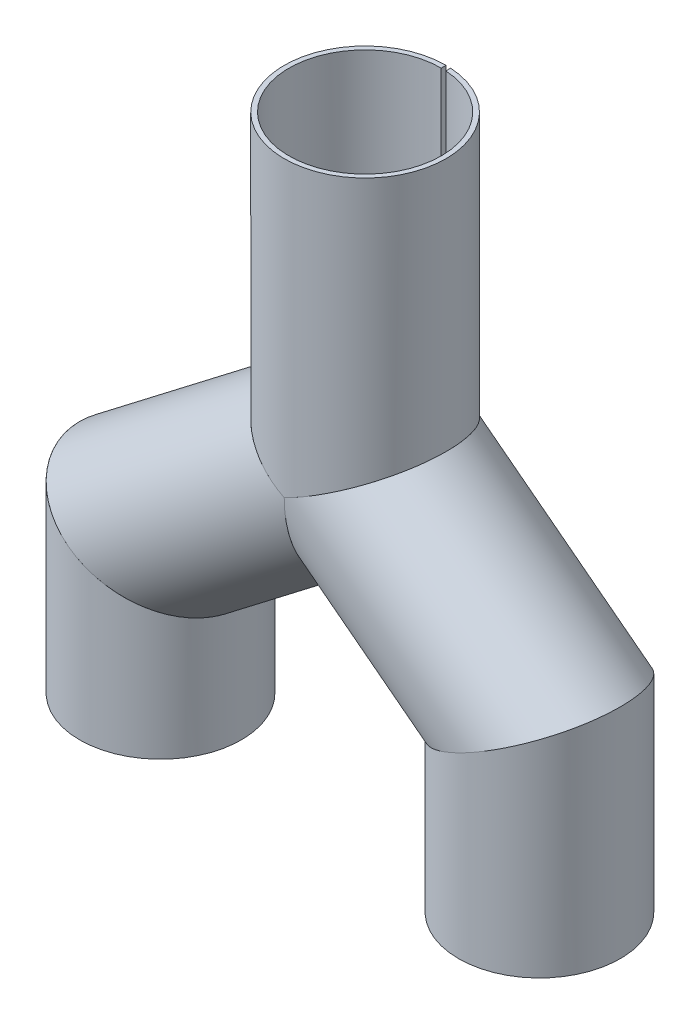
ISO-10303-21;
HEADER;
FILE_DESCRIPTION(('STEP AP214'),'2;1');
FILE_NAME('part.step','',(''),(''),'','','');
FILE_SCHEMA(('AUTOMOTIVE_DESIGN { 1 0 10303 214 1 1 1 1 }'));
ENDSEC;
DATA;
#1=APPLICATION_CONTEXT('core data for automotive mechanical design processes');
#2=APPLICATION_PROTOCOL_DEFINITION('international standard','automotive_design',2000,#1);
#3=PRODUCT_CONTEXT('',#1,'mechanical');
#4=PRODUCT('Part','Part','',(#3));
#5=PRODUCT_RELATED_PRODUCT_CATEGORY('part','',(#4));
#6=PRODUCT_DEFINITION_FORMATION('','',#4);
#7=PRODUCT_DEFINITION_CONTEXT('part definition',#1,'design');
#8=PRODUCT_DEFINITION('design','',#6,#7);
#9=PRODUCT_DEFINITION_SHAPE('','',#8);
#10=(LENGTH_UNIT() NAMED_UNIT(*) SI_UNIT(.MILLI.,.METRE.));
#11=(NAMED_UNIT(*) PLANE_ANGLE_UNIT() SI_UNIT($,.RADIAN.));
#12=(NAMED_UNIT(*) SI_UNIT($,.STERADIAN.) SOLID_ANGLE_UNIT());
#13=UNCERTAINTY_MEASURE_WITH_UNIT(LENGTH_MEASURE(1.E-05),#10,'distance_accuracy_value','');
#14=(GEOMETRIC_REPRESENTATION_CONTEXT(3) GLOBAL_UNCERTAINTY_ASSIGNED_CONTEXT((#13)) GLOBAL_UNIT_ASSIGNED_CONTEXT((#10,
#11,#12)) REPRESENTATION_CONTEXT('',''));
#15=CARTESIAN_POINT('',(0.,0.,0.));
#16=DIRECTION('',(0.,0.,1.));
#17=DIRECTION('',(1.,0.,0.));
#18=AXIS2_PLACEMENT_3D('',#15,#16,#17);
#19=CARTESIAN_POINT('',(-42.9377584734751,-24.5860223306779,0.));
#20=DIRECTION('',(0.,-1.,0.));
#21=DIRECTION('',(0.,0.,-1.));
#22=AXIS2_PLACEMENT_3D('',#19,#20,#21);
#23=CYLINDRICAL_SURFACE('',#22,16.9771800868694);
#24=CARTESIAN_POINT('',(-42.9377584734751,-65.4896522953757,0.));
#25=DIRECTION('',(0.,1.,0.));
#26=DIRECTION('',(0.,0.,1.));
#27=AXIS2_PLACEMENT_3D('',#24,#25,#26);
#28=CIRCLE('',#27,16.9771800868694);
#29=CARTESIAN_POINT('',(-43.4377584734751,-65.4896522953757,-16.9698156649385));
#30=VERTEX_POINT('',#29);
#31=CARTESIAN_POINT('',(-42.4377584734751,-65.4896522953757,-16.9698156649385));
#32=VERTEX_POINT('',#31);
#33=EDGE_CURVE('E129',#30,#32,#28,.T.);
#34=ORIENTED_EDGE('',*,*,#33,.T.);
#35=DIRECTION('',(0.,-1.,0.));
#36=VECTOR('',#35,1.);
#37=CARTESIAN_POINT('',(-42.4377584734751,-24.5860223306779,-16.9698156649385));
#38=LINE('',#37,#36);
#39=CARTESIAN_POINT('',(-42.4377584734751,-33.203305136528,-16.9698156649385));
#40=VERTEX_POINT('',#39);
#41=EDGE_CURVE('E141',#32,#40,#38,.F.);
#42=ORIENTED_EDGE('',*,*,#41,.T.);
#43=CARTESIAN_POINT('',(-42.9377584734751,-32.9567755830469,0.));
#44=DIRECTION('',(0.442226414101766,0.8969034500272,0.));
#45=DIRECTION('',(0.8969034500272,-0.442226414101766,0.));
#46=AXIS2_PLACEMENT_3D('',#43,#44,#45);
#47=ELLIPSE('',#46,18.928659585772,16.9771800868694);
#48=CARTESIAN_POINT('',(-43.4377584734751,-32.7102460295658,-16.9698156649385));
#49=VERTEX_POINT('',#48);
#50=EDGE_CURVE('E140',#49,#40,#47,.T.);
#51=ORIENTED_EDGE('',*,*,#50,.F.);
#52=DIRECTION('',(0.,-1.,0.));
#53=VECTOR('',#52,1.);
#54=CARTESIAN_POINT('',(-43.4377584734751,-24.5860223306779,-16.9698156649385));
#55=LINE('',#54,#53);
#56=EDGE_CURVE('E99',#30,#49,#55,.F.);
#57=ORIENTED_EDGE('',*,*,#56,.F.);
#58=EDGE_LOOP('',(#34,#42,#51,#57));
#59=FACE_BOUND('',#58,.T.);
#60=ADVANCED_FACE('F85',(#59),#23,.T.);
#61=CARTESIAN_POINT('',(-42.9377584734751,-24.5860223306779,0.));
#62=DIRECTION('',(0.,-1.,0.));
#63=DIRECTION('',(0.,0.,-1.));
#64=AXIS2_PLACEMENT_3D('',#61,#62,#63);
#65=CYLINDRICAL_SURFACE('',#64,15.9771800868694);
#66=DIRECTION('',(0.,-1.,0.));
#67=VECTOR('',#66,1.);
#68=CARTESIAN_POINT('',(-42.4377584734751,-24.5860223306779,-15.9693545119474));
#69=LINE('',#68,#67);
#70=CARTESIAN_POINT('',(-42.4377584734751,-65.4896522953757,-15.9693545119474));
#71=VERTEX_POINT('',#70);
#72=CARTESIAN_POINT('',(-42.4377584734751,-33.203305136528,-15.9693545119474));
#73=VERTEX_POINT('',#72);
#74=EDGE_CURVE('E106',#71,#73,#69,.F.);
#75=ORIENTED_EDGE('',*,*,#74,.F.);
#76=CARTESIAN_POINT('',(-42.9377584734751,-65.4896522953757,0.));
#77=DIRECTION('',(0.,1.,0.));
#78=DIRECTION('',(-1.,0.,0.));
#79=AXIS2_PLACEMENT_3D('',#76,#77,#78);
#80=CIRCLE('',#79,15.9771800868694);
#81=CARTESIAN_POINT('',(-43.4377584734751,-65.4896522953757,-15.9693545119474));
#82=VERTEX_POINT('',#81);
#83=EDGE_CURVE('E136',#82,#71,#80,.T.);
#84=ORIENTED_EDGE('',*,*,#83,.F.);
#85=DIRECTION('',(0.,-1.,0.));
#86=VECTOR('',#85,1.);
#87=CARTESIAN_POINT('',(-43.4377584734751,-24.5860223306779,-15.9693545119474));
#88=LINE('',#87,#86);
#89=CARTESIAN_POINT('',(-43.4377584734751,-32.7102460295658,-15.9693545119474));
#90=VERTEX_POINT('',#89);
#91=EDGE_CURVE('E123',#82,#90,#88,.F.);
#92=ORIENTED_EDGE('',*,*,#91,.T.);
#93=CARTESIAN_POINT('',(-42.9377584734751,-32.9567755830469,0.));
#94=DIRECTION('',(0.442226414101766,0.8969034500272,0.));
#95=DIRECTION('',(0.8969034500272,-0.442226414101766,0.));
#96=AXIS2_PLACEMENT_3D('',#93,#94,#95);
#97=ELLIPSE('',#96,17.8137123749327,15.9771800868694);
#98=EDGE_CURVE('E134',#90,#73,#97,.T.);
#99=ORIENTED_EDGE('',*,*,#98,.T.);
#100=EDGE_LOOP('',(#75,#84,#92,#99));
#101=FACE_BOUND('',#100,.T.);
#102=ADVANCED_FACE('F133',(#101),#65,.F.);
#103=CARTESIAN_POINT('',(-42.9377584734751,-65.4896522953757,0.));
#104=DIRECTION('',(0.,1.,0.));
#105=DIRECTION('',(0.,0.,1.));
#106=AXIS2_PLACEMENT_3D('',#103,#104,#105);
#107=PLANE('',#106);
#108=ORIENTED_EDGE('',*,*,#83,.T.);
#109=DIRECTION('',(0.,0.,1.));
#110=VECTOR('',#109,1.);
#111=CARTESIAN_POINT('',(-42.4377584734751,-65.4896522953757,-16.9771800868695));
#112=LINE('',#111,#110);
#113=EDGE_CURVE('E137',#32,#71,#112,.T.);
#114=ORIENTED_EDGE('',*,*,#113,.F.);
#115=ORIENTED_EDGE('',*,*,#33,.F.);
#116=DIRECTION('',(0.,0.,1.));
#117=VECTOR('',#116,1.);
#118=CARTESIAN_POINT('',(-43.4377584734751,-65.4896522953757,-16.9771800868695));
#119=LINE('',#118,#117);
#120=EDGE_CURVE('E152',#30,#82,#119,.T.);
#121=ORIENTED_EDGE('',*,*,#120,.T.);
#122=EDGE_LOOP('',(#108,#114,#115,#121));
#123=FACE_BOUND('',#122,.T.);
#124=ADVANCED_FACE('F158',(#123),#107,.F.);
#125=CARTESIAN_POINT('',(-59.9149385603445,-24.5860223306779,-16.9771800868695));
#126=DIRECTION('',(0.442226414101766,0.8969034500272,0.));
#127=DIRECTION('',(-0.8969034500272,0.442226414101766,0.));
#128=AXIS2_PLACEMENT_3D('',#125,#126,#127);
#129=PLANE('',#128);
#130=DIRECTION('',(0.,0.,-1.));
#131=VECTOR('',#130,1.);
#132=CARTESIAN_POINT('',(-42.4377584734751,-33.203305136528,-16.9771800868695));
#133=LINE('',#132,#131);
#134=EDGE_CURVE('E14',#73,#40,#133,.T.);
#135=ORIENTED_EDGE('',*,*,#134,.F.);
#136=ORIENTED_EDGE('',*,*,#98,.F.);
#137=DIRECTION('',(0.,0.,-1.));
#138=VECTOR('',#137,1.);
#139=CARTESIAN_POINT('',(-43.4377584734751,-32.7102460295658,-16.9771800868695));
#140=LINE('',#139,#138);
#141=EDGE_CURVE('E92',#90,#49,#140,.T.);
#142=ORIENTED_EDGE('',*,*,#141,.T.);
#143=ORIENTED_EDGE('',*,*,#50,.T.);
#144=EDGE_LOOP('',(#135,#136,#142,#143));
#145=FACE_BOUND('',#144,.T.);
#146=ADVANCED_FACE('F139',(#145),#129,.T.);
#147=CARTESIAN_POINT('',(-43.4377584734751,-32.9567755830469,-16.9771800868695));
#148=DIRECTION('',(1.,0.,0.));
#149=DIRECTION('',(0.,0.,-1.));
#150=AXIS2_PLACEMENT_3D('',#147,#148,#149);
#151=PLANE('',#150);
#152=ORIENTED_EDGE('',*,*,#56,.T.);
#153=ORIENTED_EDGE('',*,*,#141,.F.);
#154=ORIENTED_EDGE('',*,*,#91,.F.);
#155=ORIENTED_EDGE('',*,*,#120,.F.);
#156=EDGE_LOOP('',(#152,#153,#154,#155));
#157=FACE_BOUND('',#156,.T.);
#158=ADVANCED_FACE('F122',(#157),#151,.T.);
#159=CARTESIAN_POINT('',(-42.4377584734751,-32.9567755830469,-16.9771800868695));
#160=DIRECTION('',(1.,0.,0.));
#161=DIRECTION('',(0.,0.,-1.));
#162=AXIS2_PLACEMENT_3D('',#159,#160,#161);
#163=PLANE('',#162);
#164=ORIENTED_EDGE('',*,*,#113,.T.);
#165=ORIENTED_EDGE('',*,*,#74,.T.);
#166=ORIENTED_EDGE('',*,*,#134,.T.);
#167=ORIENTED_EDGE('',*,*,#41,.F.);
#168=EDGE_LOOP('',(#164,#165,#166,#167));
#169=FACE_BOUND('',#168,.T.);
#170=ADVANCED_FACE('F155',(#169),#163,.F.);
#171=CLOSED_SHELL('',(#60,#102,#124,#146,#158,#170));
#172=MANIFOLD_SOLID_BREP('B2',#171);
#173=CARTESIAN_POINT('',(0.,0.,0.));
#174=DIRECTION('',(-0.793268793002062,-0.608871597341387,0.));
#175=DIRECTION('',(0.608871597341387,-0.793268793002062,0.));
#176=AXIS2_PLACEMENT_3D('',#173,#174,#175);
#177=CYLINDRICAL_SURFACE('',#176,16.9771800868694);
#178=CARTESIAN_POINT('',(0.,0.,0.));
#179=DIRECTION('',(-0.442226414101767,-0.896903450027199,0.));
#180=DIRECTION('',(-0.896903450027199,0.442226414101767,0.));
#181=AXIS2_PLACEMENT_3D('',#178,#179,#180);
#182=ELLIPSE('',#181,18.928659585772,16.9771800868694);
#183=CARTESIAN_POINT('',(0.,0.,16.9771800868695));
#184=VERTEX_POINT('',#183);
#185=CARTESIAN_POINT('',(0.,0.,-16.9771800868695));
#186=VERTEX_POINT('',#185);
#187=EDGE_CURVE('E242',#184,#186,#182,.T.);
#188=ORIENTED_EDGE('',*,*,#187,.T.);
#189=CARTESIAN_POINT('',(0.,0.,0.));
#190=DIRECTION('',(-1.,0.,0.));
#191=DIRECTION('',(0.,-1.,0.));
#192=AXIS2_PLACEMENT_3D('',#189,#190,#191);
#193=ELLIPSE('',#192,21.4015479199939,16.9771800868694);
#194=EDGE_CURVE('E248',#186,#184,#193,.T.);
#195=ORIENTED_EDGE('',*,*,#194,.T.);
#196=EDGE_LOOP('',(#188,#195));
#197=FACE_BOUND('',#196,.T.);
#198=CARTESIAN_POINT('',(-42.9377584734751,-32.9567755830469,0.));
#199=DIRECTION('',(0.442226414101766,0.8969034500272,0.));
#200=DIRECTION('',(-0.8969034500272,0.442226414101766,0.));
#201=AXIS2_PLACEMENT_3D('',#198,#199,#200);
#202=ELLIPSE('',#201,18.928659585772,16.9771800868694);
#203=CARTESIAN_POINT('',(-59.9149385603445,-24.5860223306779,0.));
#204=VERTEX_POINT('',#203);
#205=EDGE_CURVE('E258',#204,#204,#202,.T.);
#206=ORIENTED_EDGE('',*,*,#205,.T.);
#207=EDGE_LOOP('',(#206));
#208=FACE_BOUND('',#207,.T.);
#209=ADVANCED_FACE('F219',(#197,#208),#177,.T.);
#210=CARTESIAN_POINT('',(0.,0.,0.));
#211=DIRECTION('',(-0.793268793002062,-0.608871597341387,0.));
#212=DIRECTION('',(0.608871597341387,-0.793268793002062,0.));
#213=AXIS2_PLACEMENT_3D('',#210,#211,#212);
#214=CYLINDRICAL_SURFACE('',#213,15.9771800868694);
#215=CARTESIAN_POINT('',(0.,0.,0.));
#216=DIRECTION('',(-1.,0.,0.));
#217=DIRECTION('',(0.,-1.,0.));
#218=AXIS2_PLACEMENT_3D('',#215,#216,#217);
#219=ELLIPSE('',#218,20.1409411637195,15.9771800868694);
#220=CARTESIAN_POINT('',(0.,0.,-15.9771800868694));
#221=VERTEX_POINT('',#220);
#222=CARTESIAN_POINT('',(0.,0.,15.9771800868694));
#223=VERTEX_POINT('',#222);
#224=EDGE_CURVE('E83',#221,#223,#219,.T.);
#225=ORIENTED_EDGE('',*,*,#224,.F.);
#226=CARTESIAN_POINT('',(0.,0.,0.));
#227=DIRECTION('',(-0.442226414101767,-0.896903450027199,0.));
#228=DIRECTION('',(-0.896903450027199,0.442226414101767,0.));
#229=AXIS2_PLACEMENT_3D('',#226,#227,#228);
#230=ELLIPSE('',#229,17.8137123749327,15.9771800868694);
#231=EDGE_CURVE('E226',#223,#221,#230,.T.);
#232=ORIENTED_EDGE('',*,*,#231,.F.);
#233=EDGE_LOOP('',(#225,#232));
#234=FACE_BOUND('',#233,.T.);
#235=CARTESIAN_POINT('',(-42.9377584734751,-32.9567755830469,0.));
#236=DIRECTION('',(0.442226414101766,0.8969034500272,0.));
#237=DIRECTION('',(-0.8969034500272,0.442226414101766,0.));
#238=AXIS2_PLACEMENT_3D('',#235,#236,#237);
#239=ELLIPSE('',#238,17.8137123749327,15.9771800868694);
#240=CARTESIAN_POINT('',(-58.9149385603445,-25.0790814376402,0.));
#241=VERTEX_POINT('',#240);
#242=EDGE_CURVE('E255',#241,#241,#239,.T.);
#243=ORIENTED_EDGE('',*,*,#242,.F.);
#244=EDGE_LOOP('',(#243));
#245=FACE_BOUND('',#244,.T.);
#246=ADVANCED_FACE('F266',(#234,#245),#214,.F.);
#247=CARTESIAN_POINT('',(-59.9149385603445,-24.5860223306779,-16.9771800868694));
#248=DIRECTION('',(0.442226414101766,0.8969034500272,0.));
#249=DIRECTION('',(-0.8969034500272,0.442226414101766,0.));
#250=AXIS2_PLACEMENT_3D('',#247,#248,#249);
#251=PLANE('',#250);
#252=ORIENTED_EDGE('',*,*,#242,.T.);
#253=EDGE_LOOP('',(#252));
#254=FACE_BOUND('',#253,.T.);
#255=ORIENTED_EDGE('',*,*,#205,.F.);
#256=EDGE_LOOP('',(#255));
#257=FACE_BOUND('',#256,.T.);
#258=ADVANCED_FACE('F264',(#254,#257),#251,.F.);
#259=CARTESIAN_POINT('',(0.,0.,-16.9771800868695));
#260=DIRECTION('',(-1.,0.,0.));
#261=DIRECTION('',(0.,0.,1.));
#262=AXIS2_PLACEMENT_3D('',#259,#260,#261);
#263=PLANE('',#262);
#264=DIRECTION('',(0.,0.,1.));
#265=VECTOR('',#264,1.);
#266=CARTESIAN_POINT('',(0.,0.,-16.9771800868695));
#267=LINE('',#266,#265);
#268=EDGE_CURVE('E244',#186,#221,#267,.T.);
#269=ORIENTED_EDGE('',*,*,#268,.T.);
#270=ORIENTED_EDGE('',*,*,#224,.T.);
#271=EDGE_CURVE('E233',#223,#184,#267,.T.);
#272=ORIENTED_EDGE('',*,*,#271,.T.);
#273=ORIENTED_EDGE('',*,*,#194,.F.);
#274=EDGE_LOOP('',(#269,#270,#272,#273));
#275=FACE_BOUND('',#274,.T.);
#276=ADVANCED_FACE('F251',(#275),#263,.F.);
#277=CARTESIAN_POINT('',(-16.9771800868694,8.370753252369,-16.9771800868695));
#278=DIRECTION('',(-0.442226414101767,-0.896903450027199,0.));
#279=DIRECTION('',(0.896903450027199,-0.442226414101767,0.));
#280=AXIS2_PLACEMENT_3D('',#277,#278,#279);
#281=PLANE('',#280);
#282=ORIENTED_EDGE('',*,*,#187,.F.);
#283=ORIENTED_EDGE('',*,*,#271,.F.);
#284=ORIENTED_EDGE('',*,*,#231,.T.);
#285=ORIENTED_EDGE('',*,*,#268,.F.);
#286=EDGE_LOOP('',(#282,#283,#284,#285));
#287=FACE_BOUND('',#286,.T.);
#288=ADVANCED_FACE('F243',(#287),#281,.F.);
#289=CLOSED_SHELL('',(#209,#246,#258,#276,#288));
#290=MANIFOLD_SOLID_BREP('B8',#289);
#291=CARTESIAN_POINT('',(36.5870512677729,-19.7115519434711,0.));
#292=DIRECTION('',(0.,-1.,0.));
#293=DIRECTION('',(0.,0.,-1.));
#294=AXIS2_PLACEMENT_3D('',#291,#292,#293);
#295=CYLINDRICAL_SURFACE('',#294,16.9771800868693);
#296=CARTESIAN_POINT('',(36.5870512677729,-28.0823051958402,0.));
#297=DIRECTION('',(-0.442226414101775,0.896903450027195,0.));
#298=DIRECTION('',(-0.896903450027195,-0.442226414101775,0.));
#299=AXIS2_PLACEMENT_3D('',#296,#297,#298);
#300=ELLIPSE('',#299,18.9286595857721,16.9771800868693);
#301=CARTESIAN_POINT('',(36.087051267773,-28.3288347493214,-16.9698156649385));
#302=VERTEX_POINT('',#301);
#303=CARTESIAN_POINT('',(37.0870512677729,-27.8357756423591,-16.9698156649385));
#304=VERTEX_POINT('',#303);
#305=EDGE_CURVE('E379',#302,#304,#300,.T.);
#306=ORIENTED_EDGE('',*,*,#305,.F.);
#307=DIRECTION('',(0.,-1.,0.));
#308=VECTOR('',#307,1.);
#309=CARTESIAN_POINT('',(36.0870512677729,-19.7115519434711,-16.9698156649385));
#310=LINE('',#309,#308);
#311=CARTESIAN_POINT('',(36.0870512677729,-65.4896522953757,-16.9698156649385));
#312=VERTEX_POINT('',#311);
#313=EDGE_CURVE('E334',#302,#312,#310,.T.);
#314=ORIENTED_EDGE('',*,*,#313,.T.);
#315=CARTESIAN_POINT('',(36.5870512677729,-65.4896522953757,0.));
#316=DIRECTION('',(0.,1.,0.));
#317=DIRECTION('',(0.,0.,1.));
#318=AXIS2_PLACEMENT_3D('',#315,#316,#317);
#319=CIRCLE('',#318,16.9771800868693);
#320=CARTESIAN_POINT('',(37.0870512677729,-65.4896522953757,-16.9698156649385));
#321=VERTEX_POINT('',#320);
#322=EDGE_CURVE('E373',#312,#321,#319,.T.);
#323=ORIENTED_EDGE('',*,*,#322,.T.);
#324=DIRECTION('',(0.,-1.,0.));
#325=VECTOR('',#324,1.);
#326=CARTESIAN_POINT('',(37.0870512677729,-19.7115519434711,-16.9698156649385));
#327=LINE('',#326,#325);
#328=EDGE_CURVE('E358',#304,#321,#327,.T.);
#329=ORIENTED_EDGE('',*,*,#328,.F.);
#330=EDGE_LOOP('',(#306,#314,#323,#329));
#331=FACE_BOUND('',#330,.T.);
#332=ADVANCED_FACE('F321',(#331),#295,.T.);
#333=CARTESIAN_POINT('',(36.5870512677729,-19.7115519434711,0.));
#334=DIRECTION('',(0.,-1.,0.));
#335=DIRECTION('',(0.,0.,-1.));
#336=AXIS2_PLACEMENT_3D('',#333,#334,#335);
#337=CYLINDRICAL_SURFACE('',#336,15.9771800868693);
#338=DIRECTION('',(0.,-1.,0.));
#339=VECTOR('',#338,1.);
#340=CARTESIAN_POINT('',(36.0870512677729,-19.7115519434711,-15.9693545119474));
#341=LINE('',#340,#339);
#342=CARTESIAN_POINT('',(36.0870512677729,-28.3288347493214,-15.9693545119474));
#343=VERTEX_POINT('',#342);
#344=CARTESIAN_POINT('',(36.0870512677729,-65.4896522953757,-15.9693545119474));
#345=VERTEX_POINT('',#344);
#346=EDGE_CURVE('E366',#343,#345,#341,.T.);
#347=ORIENTED_EDGE('',*,*,#346,.F.);
#348=CARTESIAN_POINT('',(36.5870512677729,-28.0823051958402,0.));
#349=DIRECTION('',(-0.442226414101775,0.896903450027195,0.));
#350=DIRECTION('',(-0.896903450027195,-0.442226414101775,0.));
#351=AXIS2_PLACEMENT_3D('',#348,#349,#350);
#352=ELLIPSE('',#351,17.8137123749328,15.9771800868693);
#353=CARTESIAN_POINT('',(37.0870512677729,-27.8357756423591,-15.9693545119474));
#354=VERTEX_POINT('',#353);
#355=EDGE_CURVE('E383',#343,#354,#352,.T.);
#356=ORIENTED_EDGE('',*,*,#355,.T.);
#357=DIRECTION('',(0.,-1.,0.));
#358=VECTOR('',#357,1.);
#359=CARTESIAN_POINT('',(37.0870512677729,-19.7115519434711,-15.9693545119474));
#360=LINE('',#359,#358);
#361=CARTESIAN_POINT('',(37.0870512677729,-65.4896522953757,-15.9693545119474));
#362=VERTEX_POINT('',#361);
#363=EDGE_CURVE('E342',#354,#362,#360,.T.);
#364=ORIENTED_EDGE('',*,*,#363,.T.);
#365=CARTESIAN_POINT('',(36.5870512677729,-65.4896522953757,0.));
#366=DIRECTION('',(0.,1.,0.));
#367=DIRECTION('',(-1.,0.,0.));
#368=AXIS2_PLACEMENT_3D('',#365,#366,#367);
#369=CIRCLE('',#368,15.9771800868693);
#370=EDGE_CURVE('E375',#345,#362,#369,.T.);
#371=ORIENTED_EDGE('',*,*,#370,.F.);
#372=EDGE_LOOP('',(#347,#356,#364,#371));
#373=FACE_BOUND('',#372,.T.);
#374=ADVANCED_FACE('F392',(#373),#337,.F.);
#375=CARTESIAN_POINT('',(36.5870512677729,-65.4896522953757,0.));
#376=DIRECTION('',(0.,1.,0.));
#377=DIRECTION('',(0.,0.,1.));
#378=AXIS2_PLACEMENT_3D('',#375,#376,#377);
#379=PLANE('',#378);
#380=ORIENTED_EDGE('',*,*,#322,.F.);
#381=DIRECTION('',(0.,0.,1.));
#382=VECTOR('',#381,1.);
#383=CARTESIAN_POINT('',(36.0870512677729,-65.4896522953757,-16.9771800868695));
#384=LINE('',#383,#382);
#385=EDGE_CURVE('E376',#312,#345,#384,.T.);
#386=ORIENTED_EDGE('',*,*,#385,.T.);
#387=ORIENTED_EDGE('',*,*,#370,.T.);
#388=DIRECTION('',(0.,0.,1.));
#389=VECTOR('',#388,1.);
#390=CARTESIAN_POINT('',(37.0870512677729,-65.4896522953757,-16.9771800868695));
#391=LINE('',#390,#389);
#392=EDGE_CURVE('E361',#321,#362,#391,.T.);
#393=ORIENTED_EDGE('',*,*,#392,.F.);
#394=EDGE_LOOP('',(#380,#386,#387,#393));
#395=FACE_BOUND('',#394,.T.);
#396=ADVANCED_FACE('F371',(#395),#379,.F.);
#397=CARTESIAN_POINT('',(19.6098711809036,-36.4530584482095,-16.9771800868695));
#398=DIRECTION('',(-0.442226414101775,0.896903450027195,0.));
#399=DIRECTION('',(-0.896903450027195,-0.442226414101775,0.));
#400=AXIS2_PLACEMENT_3D('',#397,#398,#399);
#401=PLANE('',#400);
#402=DIRECTION('',(0.,0.,1.));
#403=VECTOR('',#402,1.);
#404=CARTESIAN_POINT('',(36.087051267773,-28.3288347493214,-16.9771800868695));
#405=LINE('',#404,#403);
#406=EDGE_CURVE('E217',#302,#343,#405,.T.);
#407=ORIENTED_EDGE('',*,*,#406,.F.);
#408=ORIENTED_EDGE('',*,*,#305,.T.);
#409=DIRECTION('',(0.,0.,1.));
#410=VECTOR('',#409,1.);
#411=CARTESIAN_POINT('',(37.0870512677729,-27.8357756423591,-16.9771800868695));
#412=LINE('',#411,#410);
#413=EDGE_CURVE('E328',#304,#354,#412,.T.);
#414=ORIENTED_EDGE('',*,*,#413,.T.);
#415=ORIENTED_EDGE('',*,*,#355,.F.);
#416=EDGE_LOOP('',(#407,#408,#414,#415));
#417=FACE_BOUND('',#416,.T.);
#418=ADVANCED_FACE('F394',(#417),#401,.T.);
#419=CARTESIAN_POINT('',(37.0870512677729,-28.0823051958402,-16.9771800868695));
#420=DIRECTION('',(-1.,0.,0.));
#421=DIRECTION('',(0.,0.,1.));
#422=AXIS2_PLACEMENT_3D('',#419,#420,#421);
#423=PLANE('',#422);
#424=ORIENTED_EDGE('',*,*,#328,.T.);
#425=ORIENTED_EDGE('',*,*,#392,.T.);
#426=ORIENTED_EDGE('',*,*,#363,.F.);
#427=ORIENTED_EDGE('',*,*,#413,.F.);
#428=EDGE_LOOP('',(#424,#425,#426,#427));
#429=FACE_BOUND('',#428,.T.);
#430=ADVANCED_FACE('F360',(#429),#423,.T.);
#431=CARTESIAN_POINT('',(36.0870512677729,-28.0823051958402,-16.9771800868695));
#432=DIRECTION('',(-1.,0.,0.));
#433=DIRECTION('',(0.,0.,1.));
#434=AXIS2_PLACEMENT_3D('',#431,#432,#433);
#435=PLANE('',#434);
#436=ORIENTED_EDGE('',*,*,#406,.T.);
#437=ORIENTED_EDGE('',*,*,#346,.T.);
#438=ORIENTED_EDGE('',*,*,#385,.F.);
#439=ORIENTED_EDGE('',*,*,#313,.F.);
#440=EDGE_LOOP('',(#436,#437,#438,#439));
#441=FACE_BOUND('',#440,.T.);
#442=ADVANCED_FACE('F395',(#441),#435,.F.);
#443=CLOSED_SHELL('',(#332,#374,#396,#418,#430,#442));
#444=MANIFOLD_SOLID_BREP('B77',#443);
#445=CARTESIAN_POINT('',(0.,0.,0.));
#446=DIRECTION('',(0.793268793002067,-0.60887159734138,0.));
#447=DIRECTION('',(0.60887159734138,0.793268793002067,0.));
#448=AXIS2_PLACEMENT_3D('',#445,#446,#447);
#449=CYLINDRICAL_SURFACE('',#448,16.9771800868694);
#450=DIRECTION('',(0.793268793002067,-0.60887159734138,0.));
#451=VECTOR('',#450,1.);
#452=CARTESIAN_POINT('',(-0.30443579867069,-0.396634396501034,-16.9698156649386));
#453=LINE('',#452,#451);
#454=CARTESIAN_POINT('',(36.0870512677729,-28.3288347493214,-16.9698156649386));
#455=VERTEX_POINT('',#454);
#456=CARTESIAN_POINT('',(0.,-0.630303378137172,-16.9698156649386));
#457=VERTEX_POINT('',#456);
#458=EDGE_CURVE('E475',#455,#457,#453,.F.);
#459=ORIENTED_EDGE('',*,*,#458,.F.);
#460=CARTESIAN_POINT('',(36.5870512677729,-28.0823051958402,0.));
#461=DIRECTION('',(-0.442226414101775,0.896903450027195,0.));
#462=DIRECTION('',(0.896903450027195,0.442226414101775,0.));
#463=AXIS2_PLACEMENT_3D('',#460,#461,#462);
#464=ELLIPSE('',#463,18.9286595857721,16.9771800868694);
#465=CARTESIAN_POINT('',(37.0870512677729,-27.8357756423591,-16.9698156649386));
#466=VERTEX_POINT('',#465);
#467=EDGE_CURVE('E518',#466,#455,#464,.F.);
#468=ORIENTED_EDGE('',*,*,#467,.F.);
#469=DIRECTION('',(0.793268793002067,-0.60887159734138,0.));
#470=VECTOR('',#469,1.);
#471=CARTESIAN_POINT('',(0.30443579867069,0.396634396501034,-16.9698156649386));
#472=LINE('',#471,#470);
#473=CARTESIAN_POINT('',(0.499999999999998,0.246529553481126,-16.9698156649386));
#474=VERTEX_POINT('',#473);
#475=EDGE_CURVE('E531',#466,#474,#472,.F.);
#476=ORIENTED_EDGE('',*,*,#475,.T.);
#477=CARTESIAN_POINT('',(0.,0.,0.));
#478=DIRECTION('',(0.442226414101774,-0.896903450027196,0.));
#479=DIRECTION('',(0.896903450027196,0.442226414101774,0.));
#480=AXIS2_PLACEMENT_3D('',#477,#478,#479);
#481=ELLIPSE('',#480,18.9286595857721,16.9771800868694);
#482=CARTESIAN_POINT('',(0.,0.,16.9771800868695));
#483=VERTEX_POINT('',#482);
#484=EDGE_CURVE('E525',#483,#474,#481,.F.);
#485=ORIENTED_EDGE('',*,*,#484,.F.);
#486=CARTESIAN_POINT('',(0.,0.,0.));
#487=DIRECTION('',(1.,0.,0.));
#488=DIRECTION('',(0.,-1.,0.));
#489=AXIS2_PLACEMENT_3D('',#486,#487,#488);
#490=ELLIPSE('',#489,21.4015479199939,16.9771800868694);
#491=EDGE_CURVE('E528',#457,#483,#490,.F.);
#492=ORIENTED_EDGE('',*,*,#491,.F.);
#493=EDGE_LOOP('',(#459,#468,#476,#485,#492));
#494=FACE_BOUND('',#493,.T.);
#495=ADVANCED_FACE('F454',(#494),#449,.T.);
#496=CARTESIAN_POINT('',(0.,0.,-16.9771800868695));
#497=DIRECTION('',(0.442226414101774,-0.896903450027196,0.));
#498=DIRECTION('',(0.896903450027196,0.442226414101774,0.));
#499=AXIS2_PLACEMENT_3D('',#496,#497,#498);
#500=PLANE('',#499);
#501=DIRECTION('',(0.,0.,-1.));
#502=VECTOR('',#501,1.);
#503=CARTESIAN_POINT('',(0.499999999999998,0.246529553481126,-16.9771800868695));
#504=LINE('',#503,#502);
#505=CARTESIAN_POINT('',(0.499999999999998,0.246529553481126,-15.9693545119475));
#506=VERTEX_POINT('',#505);
#507=EDGE_CURVE('E319',#506,#474,#504,.T.);
#508=ORIENTED_EDGE('',*,*,#507,.F.);
#509=CARTESIAN_POINT('',(0.,0.,0.));
#510=DIRECTION('',(0.442226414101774,-0.896903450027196,0.));
#511=DIRECTION('',(0.896903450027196,0.442226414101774,0.));
#512=AXIS2_PLACEMENT_3D('',#509,#510,#511);
#513=ELLIPSE('',#512,17.8137123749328,15.9771800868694);
#514=CARTESIAN_POINT('',(0.,0.,15.9771800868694));
#515=VERTEX_POINT('',#514);
#516=EDGE_CURVE('E503',#515,#506,#513,.F.);
#517=ORIENTED_EDGE('',*,*,#516,.F.);
#518=DIRECTION('',(0.,0.,1.));
#519=VECTOR('',#518,1.);
#520=CARTESIAN_POINT('',(0.,0.,-16.9771800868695));
#521=LINE('',#520,#519);
#522=EDGE_CURVE('E516',#515,#483,#521,.T.);
#523=ORIENTED_EDGE('',*,*,#522,.T.);
#524=ORIENTED_EDGE('',*,*,#484,.T.);
#525=EDGE_LOOP('',(#508,#517,#523,#524));
#526=FACE_BOUND('',#525,.T.);
#527=ADVANCED_FACE('F545',(#526),#500,.F.);
#528=CARTESIAN_POINT('',(0.,0.,0.));
#529=DIRECTION('',(0.793268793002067,-0.60887159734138,0.));
#530=DIRECTION('',(0.60887159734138,0.793268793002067,0.));
#531=AXIS2_PLACEMENT_3D('',#528,#529,#530);
#532=CYLINDRICAL_SURFACE('',#531,15.9771800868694);
#533=CARTESIAN_POINT('',(36.5870512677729,-28.0823051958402,0.));
#534=DIRECTION('',(-0.442226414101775,0.896903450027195,0.));
#535=DIRECTION('',(0.896903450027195,0.442226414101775,0.));
#536=AXIS2_PLACEMENT_3D('',#533,#534,#535);
#537=ELLIPSE('',#536,17.8137123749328,15.9771800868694);
#538=CARTESIAN_POINT('',(37.0870512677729,-27.8357756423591,-15.9693545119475));
#539=VERTEX_POINT('',#538);
#540=CARTESIAN_POINT('',(36.0870512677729,-28.3288347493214,-15.9693545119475));
#541=VERTEX_POINT('',#540);
#542=EDGE_CURVE('E511',#539,#541,#537,.F.);
#543=ORIENTED_EDGE('',*,*,#542,.T.);
#544=DIRECTION('',(0.793268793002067,-0.60887159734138,0.));
#545=VECTOR('',#544,1.);
#546=CARTESIAN_POINT('',(-0.30443579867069,-0.396634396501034,-15.9693545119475));
#547=LINE('',#546,#545);
#548=CARTESIAN_POINT('',(0.,-0.630303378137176,-15.9693545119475));
#549=VERTEX_POINT('',#548);
#550=EDGE_CURVE('E498',#541,#549,#547,.F.);
#551=ORIENTED_EDGE('',*,*,#550,.T.);
#552=CARTESIAN_POINT('',(0.,0.,0.));
#553=DIRECTION('',(1.,0.,0.));
#554=DIRECTION('',(0.,-1.,0.));
#555=AXIS2_PLACEMENT_3D('',#552,#553,#554);
#556=ELLIPSE('',#555,20.1409411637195,15.9771800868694);
#557=EDGE_CURVE('E508',#549,#515,#556,.F.);
#558=ORIENTED_EDGE('',*,*,#557,.T.);
#559=ORIENTED_EDGE('',*,*,#516,.T.);
#560=DIRECTION('',(0.793268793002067,-0.60887159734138,0.));
#561=VECTOR('',#560,1.);
#562=CARTESIAN_POINT('',(0.30443579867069,0.396634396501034,-15.9693545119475));
#563=LINE('',#562,#561);
#564=EDGE_CURVE('E467',#539,#506,#563,.F.);
#565=ORIENTED_EDGE('',*,*,#564,.F.);
#566=EDGE_LOOP('',(#543,#551,#558,#559,#565));
#567=FACE_BOUND('',#566,.T.);
#568=ADVANCED_FACE('F506',(#567),#532,.F.);
#569=CARTESIAN_POINT('',(19.6098711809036,-36.4530584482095,-16.9771800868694));
#570=DIRECTION('',(-0.442226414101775,0.896903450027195,0.));
#571=DIRECTION('',(-0.896903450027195,-0.442226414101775,0.));
#572=AXIS2_PLACEMENT_3D('',#569,#570,#571);
#573=PLANE('',#572);
#574=ORIENTED_EDGE('',*,*,#467,.T.);
#575=DIRECTION('',(0.,0.,1.));
#576=VECTOR('',#575,1.);
#577=CARTESIAN_POINT('',(36.0870512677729,-28.3288347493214,-16.9771800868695));
#578=LINE('',#577,#576);
#579=EDGE_CURVE('E512',#455,#541,#578,.T.);
#580=ORIENTED_EDGE('',*,*,#579,.T.);
#581=ORIENTED_EDGE('',*,*,#542,.F.);
#582=DIRECTION('',(0.,0.,1.));
#583=VECTOR('',#582,1.);
#584=CARTESIAN_POINT('',(37.0870512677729,-27.8357756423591,-16.9771800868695));
#585=LINE('',#584,#583);
#586=EDGE_CURVE('E536',#466,#539,#585,.T.);
#587=ORIENTED_EDGE('',*,*,#586,.F.);
#588=EDGE_LOOP('',(#574,#580,#581,#587));
#589=FACE_BOUND('',#588,.T.);
#590=ADVANCED_FACE('F539',(#589),#573,.F.);
#591=CARTESIAN_POINT('',(0.,0.,-16.9771800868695));
#592=DIRECTION('',(1.,0.,0.));
#593=DIRECTION('',(0.,0.,-1.));
#594=AXIS2_PLACEMENT_3D('',#591,#592,#593);
#595=PLANE('',#594);
#596=ORIENTED_EDGE('',*,*,#557,.F.);
#597=DIRECTION('',(0.,0.,-1.));
#598=VECTOR('',#597,1.);
#599=CARTESIAN_POINT('',(0.,-0.630303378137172,-16.9771800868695));
#600=LINE('',#599,#598);
#601=EDGE_CURVE('E461',#549,#457,#600,.T.);
#602=ORIENTED_EDGE('',*,*,#601,.T.);
#603=ORIENTED_EDGE('',*,*,#491,.T.);
#604=ORIENTED_EDGE('',*,*,#522,.F.);
#605=EDGE_LOOP('',(#596,#602,#603,#604));
#606=FACE_BOUND('',#605,.T.);
#607=ADVANCED_FACE('F514',(#606),#595,.F.);
#608=CARTESIAN_POINT('',(-0.30443579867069,-0.396634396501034,-16.9771800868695));
#609=DIRECTION('',(-0.60887159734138,-0.793268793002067,0.));
#610=DIRECTION('',(0.793268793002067,-0.60887159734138,0.));
#611=AXIS2_PLACEMENT_3D('',#608,#609,#610);
#612=PLANE('',#611);
#613=ORIENTED_EDGE('',*,*,#458,.T.);
#614=ORIENTED_EDGE('',*,*,#601,.F.);
#615=ORIENTED_EDGE('',*,*,#550,.F.);
#616=ORIENTED_EDGE('',*,*,#579,.F.);
#617=EDGE_LOOP('',(#613,#614,#615,#616));
#618=FACE_BOUND('',#617,.T.);
#619=ADVANCED_FACE('F497',(#618),#612,.F.);
#620=CARTESIAN_POINT('',(0.30443579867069,0.396634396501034,-16.9771800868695));
#621=DIRECTION('',(-0.60887159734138,-0.793268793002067,0.));
#622=DIRECTION('',(0.793268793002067,-0.60887159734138,0.));
#623=AXIS2_PLACEMENT_3D('',#620,#621,#622);
#624=PLANE('',#623);
#625=ORIENTED_EDGE('',*,*,#586,.T.);
#626=ORIENTED_EDGE('',*,*,#564,.T.);
#627=ORIENTED_EDGE('',*,*,#507,.T.);
#628=ORIENTED_EDGE('',*,*,#475,.F.);
#629=EDGE_LOOP('',(#625,#626,#627,#628));
#630=FACE_BOUND('',#629,.T.);
#631=ADVANCED_FACE('F546',(#630),#624,.T.);
#632=CLOSED_SHELL('',(#495,#527,#568,#590,#607,#619,#631));
#633=MANIFOLD_SOLID_BREP('B211',#632);
#634=CARTESIAN_POINT('',(0.,61.615296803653,0.));
#635=DIRECTION('',(0.,1.,0.));
#636=DIRECTION('',(0.,0.,1.));
#637=AXIS2_PLACEMENT_3D('',#634,#635,#636);
#638=PLANE('',#637);
#639=DIRECTION('',(0.,0.,1.));
#640=VECTOR('',#639,1.);
#641=CARTESIAN_POINT('',(1.,61.615296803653,-16.9771800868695));
#642=LINE('',#641,#640);
#643=CARTESIAN_POINT('',(1.,61.615296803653,-16.9477031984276));
#644=VERTEX_POINT('',#643);
#645=CARTESIAN_POINT('',(1.,61.615296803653,-15.9458547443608));
#646=VERTEX_POINT('',#645);
#647=EDGE_CURVE('E661',#644,#646,#642,.T.);
#648=ORIENTED_EDGE('',*,*,#647,.T.);
#649=CARTESIAN_POINT('',(0.,61.615296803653,0.));
#650=DIRECTION('',(0.,1.,0.));
#651=DIRECTION('',(1.,0.,0.));
#652=AXIS2_PLACEMENT_3D('',#649,#650,#651);
#653=CIRCLE('',#652,15.9771800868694);
#654=CARTESIAN_POINT('',(0.,61.615296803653,-15.9771800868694));
#655=VERTEX_POINT('',#654);
#656=EDGE_CURVE('E669',#655,#646,#653,.T.);
#657=ORIENTED_EDGE('',*,*,#656,.F.);
#658=DIRECTION('',(0.,0.,1.));
#659=VECTOR('',#658,1.);
#660=CARTESIAN_POINT('',(0.,61.615296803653,-16.9771800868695));
#661=LINE('',#660,#659);
#662=CARTESIAN_POINT('',(0.,61.615296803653,-16.9771800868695));
#663=VERTEX_POINT('',#662);
#664=EDGE_CURVE('E653',#663,#655,#661,.T.);
#665=ORIENTED_EDGE('',*,*,#664,.F.);
#666=CARTESIAN_POINT('',(0.,61.615296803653,0.));
#667=DIRECTION('',(0.,1.,0.));
#668=DIRECTION('',(0.,0.,1.));
#669=AXIS2_PLACEMENT_3D('',#666,#667,#668);
#670=CIRCLE('',#669,16.9771800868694);
#671=EDGE_CURVE('E667',#663,#644,#670,.T.);
#672=ORIENTED_EDGE('',*,*,#671,.T.);
#673=EDGE_LOOP('',(#648,#657,#665,#672));
#674=FACE_BOUND('',#673,.T.);
#675=ADVANCED_FACE('F604',(#674),#638,.T.);
#676=CARTESIAN_POINT('',(0.,61.615296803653,0.));
#677=DIRECTION('',(0.,-1.,0.));
#678=DIRECTION('',(0.,0.,-1.));
#679=AXIS2_PLACEMENT_3D('',#676,#677,#678);
#680=CYLINDRICAL_SURFACE('',#679,16.9771800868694);
#681=CARTESIAN_POINT('',(0.,0.,0.));
#682=DIRECTION('',(-0.442226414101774,0.896903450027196,0.));
#683=DIRECTION('',(-0.896903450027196,-0.442226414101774,0.));
#684=AXIS2_PLACEMENT_3D('',#681,#682,#683);
#685=ELLIPSE('',#684,18.9286595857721,16.9771800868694);
#686=CARTESIAN_POINT('',(0.,0.,16.9771800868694));
#687=VERTEX_POINT('',#686);
#688=CARTESIAN_POINT('',(1.,0.493059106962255,-16.9477031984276));
#689=VERTEX_POINT('',#688);
#690=EDGE_CURVE('E688',#687,#689,#685,.T.);
#691=ORIENTED_EDGE('',*,*,#690,.T.);
#692=DIRECTION('',(0.,-1.,0.));
#693=VECTOR('',#692,1.);
#694=CARTESIAN_POINT('',(1.,61.615296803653,-16.9477031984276));
#695=LINE('',#694,#693);
#696=EDGE_CURVE('E619',#689,#644,#695,.F.);
#697=ORIENTED_EDGE('',*,*,#696,.T.);
#698=ORIENTED_EDGE('',*,*,#671,.F.);
#699=DIRECTION('',(0.,1.,0.));
#700=VECTOR('',#699,1.);
#701=CARTESIAN_POINT('',(0.,0.,-16.9771800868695));
#702=LINE('',#701,#700);
#703=CARTESIAN_POINT('',(0.,0.,-16.9771800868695));
#704=VERTEX_POINT('',#703);
#705=EDGE_CURVE('E650',#704,#663,#702,.T.);
#706=ORIENTED_EDGE('',*,*,#705,.F.);
#707=CARTESIAN_POINT('',(0.,0.,0.));
#708=DIRECTION('',(0.442226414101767,0.896903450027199,0.));
#709=DIRECTION('',(0.896903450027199,-0.442226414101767,0.));
#710=AXIS2_PLACEMENT_3D('',#707,#708,#709);
#711=ELLIPSE('',#710,18.928659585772,16.9771800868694);
#712=EDGE_CURVE('E676',#704,#687,#711,.T.);
#713=ORIENTED_EDGE('',*,*,#712,.T.);
#714=EDGE_LOOP('',(#691,#697,#698,#706,#713));
#715=FACE_BOUND('',#714,.T.);
#716=ADVANCED_FACE('F606',(#715),#680,.T.);
#717=CARTESIAN_POINT('',(0.,61.615296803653,0.));
#718=DIRECTION('',(0.,-1.,0.));
#719=DIRECTION('',(0.,0.,-1.));
#720=AXIS2_PLACEMENT_3D('',#717,#718,#719);
#721=CYLINDRICAL_SURFACE('',#720,15.9771800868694);
#722=DIRECTION('',(0.,-1.,0.));
#723=VECTOR('',#722,1.);
#724=CARTESIAN_POINT('',(1.,61.615296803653,-15.9458547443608));
#725=LINE('',#724,#723);
#726=CARTESIAN_POINT('',(1.,0.493059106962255,-15.9458547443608));
#727=VERTEX_POINT('',#726);
#728=EDGE_CURVE('E686',#727,#646,#725,.F.);
#729=ORIENTED_EDGE('',*,*,#728,.F.);
#730=CARTESIAN_POINT('',(0.,0.,0.));
#731=DIRECTION('',(-0.442226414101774,0.896903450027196,0.));
#732=DIRECTION('',(-0.896903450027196,-0.442226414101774,0.));
#733=AXIS2_PLACEMENT_3D('',#730,#731,#732);
#734=ELLIPSE('',#733,17.8137123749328,15.9771800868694);
#735=CARTESIAN_POINT('',(0.,0.,15.9771800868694));
#736=VERTEX_POINT('',#735);
#737=EDGE_CURVE('E673',#736,#727,#734,.T.);
#738=ORIENTED_EDGE('',*,*,#737,.F.);
#739=CARTESIAN_POINT('',(0.,0.,0.));
#740=DIRECTION('',(0.442226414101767,0.896903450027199,0.));
#741=DIRECTION('',(0.896903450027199,-0.442226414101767,0.));
#742=AXIS2_PLACEMENT_3D('',#739,#740,#741);
#743=ELLIPSE('',#742,17.8137123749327,15.9771800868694);
#744=CARTESIAN_POINT('',(0.,0.,-15.9771800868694));
#745=VERTEX_POINT('',#744);
#746=EDGE_CURVE('E612',#745,#736,#743,.T.);
#747=ORIENTED_EDGE('',*,*,#746,.F.);
#748=DIRECTION('',(0.,-1.,0.));
#749=VECTOR('',#748,1.);
#750=CARTESIAN_POINT('',(0.,61.615296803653,-15.9771800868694));
#751=LINE('',#750,#749);
#752=EDGE_CURVE('E670',#745,#655,#751,.F.);
#753=ORIENTED_EDGE('',*,*,#752,.T.);
#754=ORIENTED_EDGE('',*,*,#656,.T.);
#755=EDGE_LOOP('',(#729,#738,#747,#753,#754));
#756=FACE_BOUND('',#755,.T.);
#757=ADVANCED_FACE('F685',(#756),#721,.F.);
#758=CARTESIAN_POINT('',(-33.9543601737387,16.741506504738,-16.9771800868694));
#759=DIRECTION('',(0.442226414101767,0.896903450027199,0.));
#760=DIRECTION('',(-0.896903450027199,0.442226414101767,0.));
#761=AXIS2_PLACEMENT_3D('',#758,#759,#760);
#762=PLANE('',#761);
#763=DIRECTION('',(0.,0.,1.));
#764=VECTOR('',#763,1.);
#765=CARTESIAN_POINT('',(0.,0.,-16.9771800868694));
#766=LINE('',#765,#764);
#767=EDGE_CURVE('E656',#704,#745,#766,.T.);
#768=ORIENTED_EDGE('',*,*,#767,.T.);
#769=ORIENTED_EDGE('',*,*,#746,.T.);
#770=EDGE_CURVE('E626',#736,#687,#766,.T.);
#771=ORIENTED_EDGE('',*,*,#770,.T.);
#772=ORIENTED_EDGE('',*,*,#712,.F.);
#773=EDGE_LOOP('',(#768,#769,#771,#772));
#774=FACE_BOUND('',#773,.T.);
#775=ADVANCED_FACE('F682',(#774),#762,.F.);
#776=CARTESIAN_POINT('',(0.,0.,-16.9771800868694));
#777=DIRECTION('',(-0.442226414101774,0.896903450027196,0.));
#778=DIRECTION('',(-0.896903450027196,-0.442226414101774,0.));
#779=AXIS2_PLACEMENT_3D('',#776,#777,#778);
#780=PLANE('',#779);
#781=ORIENTED_EDGE('',*,*,#737,.T.);
#782=DIRECTION('',(0.,0.,-1.));
#783=VECTOR('',#782,1.);
#784=CARTESIAN_POINT('',(1.,0.493059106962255,-16.9771800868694));
#785=LINE('',#784,#783);
#786=EDGE_CURVE('E452',#727,#689,#785,.T.);
#787=ORIENTED_EDGE('',*,*,#786,.T.);
#788=ORIENTED_EDGE('',*,*,#690,.F.);
#789=ORIENTED_EDGE('',*,*,#770,.F.);
#790=EDGE_LOOP('',(#781,#787,#788,#789));
#791=FACE_BOUND('',#790,.T.);
#792=ADVANCED_FACE('F687',(#791),#780,.F.);
#793=CARTESIAN_POINT('',(0.,0.,-16.9771800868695));
#794=DIRECTION('',(1.,0.,0.));
#795=DIRECTION('',(0.,0.,-1.));
#796=AXIS2_PLACEMENT_3D('',#793,#794,#795);
#797=PLANE('',#796);
#798=ORIENTED_EDGE('',*,*,#767,.F.);
#799=ORIENTED_EDGE('',*,*,#705,.T.);
#800=ORIENTED_EDGE('',*,*,#664,.T.);
#801=ORIENTED_EDGE('',*,*,#752,.F.);
#802=EDGE_LOOP('',(#798,#799,#800,#801));
#803=FACE_BOUND('',#802,.T.);
#804=ADVANCED_FACE('F652',(#803),#797,.T.);
#805=CARTESIAN_POINT('',(1.,0.,-16.9771800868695));
#806=DIRECTION('',(1.,0.,0.));
#807=DIRECTION('',(0.,0.,-1.));
#808=AXIS2_PLACEMENT_3D('',#805,#806,#807);
#809=PLANE('',#808);
#810=ORIENTED_EDGE('',*,*,#786,.F.);
#811=ORIENTED_EDGE('',*,*,#728,.T.);
#812=ORIENTED_EDGE('',*,*,#647,.F.);
#813=ORIENTED_EDGE('',*,*,#696,.F.);
#814=EDGE_LOOP('',(#810,#811,#812,#813));
#815=FACE_BOUND('',#814,.T.);
#816=ADVANCED_FACE('F695',(#815),#809,.F.);
#817=CLOSED_SHELL('',(#675,#716,#757,#775,#792,#804,#816));
#818=MANIFOLD_SOLID_BREP('B313',#817);
#819=ADVANCED_BREP_SHAPE_REPRESENTATION('',(#18,#172,#290,#444,#633,#818),#14);
#820=SHAPE_DEFINITION_REPRESENTATION(#9,#819);
ENDSEC;
END-ISO-10303-21;
